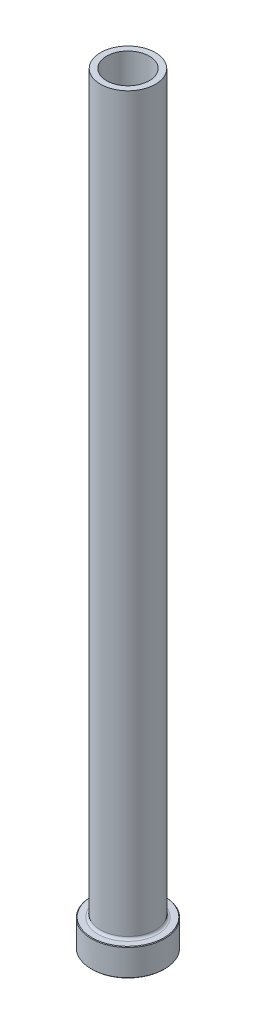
from build123d import *

# Parameters (mm, degrees)
FILLET1_R     = 0.8
CHAMFER1_SIZE = 0.2
CHAMFER3_SIZE = 0.5


with BuildPart() as part:
    # Sketch1 → Revolve1 (revolve)
    with BuildSketch(Plane.XY, mode=Mode.PRIVATE) as revolve1_sk:
        Polygon((-7, 250), (-9, 250), (-9, 9), (-12, 9), (-12, 0), (-7.25, 0), (-7.25, 183), (-7, 195), align=None)
    revolve(revolve1_sk.sketch.rotate(Axis((0, 92.187680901, 0), (0, -1, 0)), 270), axis=Axis((0, 92.187680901, 0), (0, -1, 0)))

    # Fillet1
    fillet1_edges = [part.edges().sort_by_distance(p)[0] for p in [
        (0, 9, -9),
    ]]
    fillet(fillet1_edges, radius=FILLET1_R)

    # Chamfer1
    chamfer1_edges = [part.edges().sort_by_distance(p)[0] for p in [
        (0, 0, -12),
        (0, 9, -12),
    ]]
    chamfer(chamfer1_edges, length=CHAMFER1_SIZE)

    # Chamfer3
    chamfer3_edges = [part.edges().sort_by_distance(p)[0] for p in [
        (0, 0, -7.25),
    ]]
    chamfer(chamfer3_edges, length=CHAMFER3_SIZE)


solid = part.part
